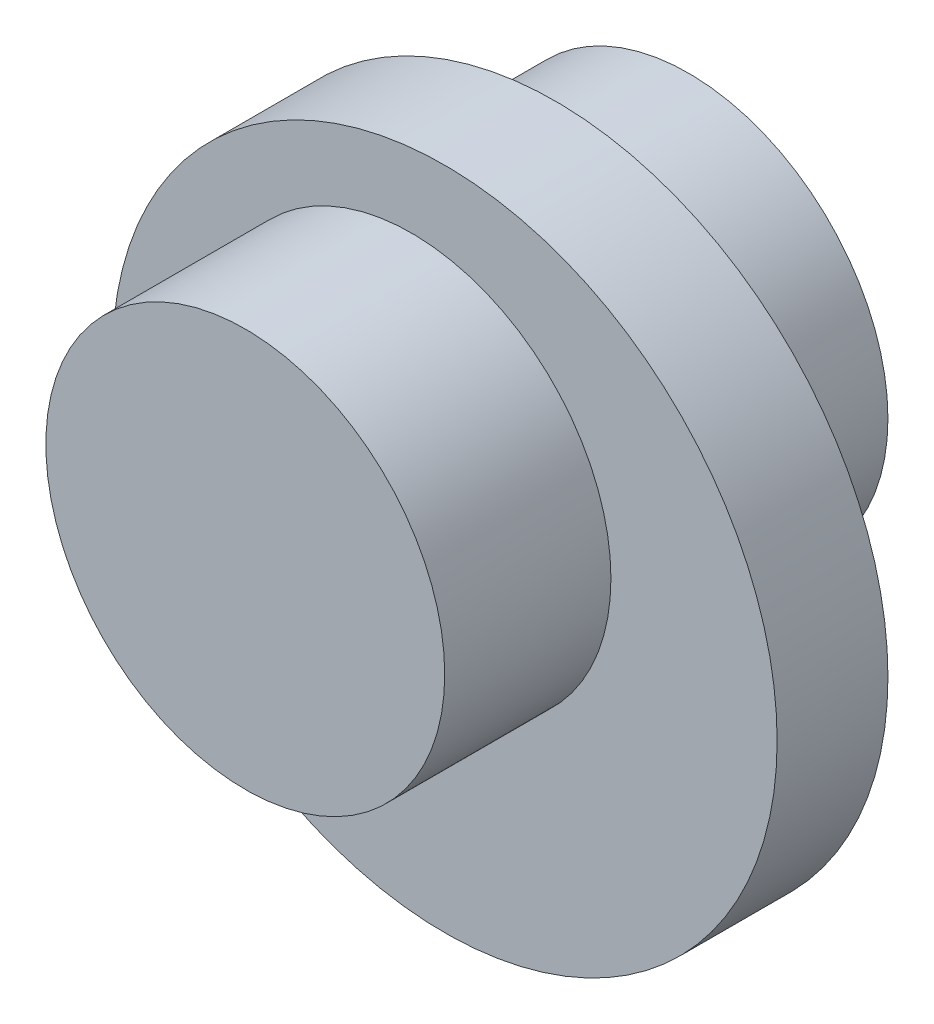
from build123d import *

# Parameters (mm, degrees)
ESQUISSE1_R      = 9
EXTRUSION1_DEPTH = 10
ESQUISSE2_R      = 15
EXTRUSION2_DEPTH = 2.5


with BuildPart() as part:
    # Esquisse1 → Extrusion1 (new, symmetric)
    with BuildSketch(Plane.XY):
        Circle(ESQUISSE1_R)
    extrude(amount=EXTRUSION1_DEPTH, both=True)

    # Esquisse2 → Extrusion2 (add, symmetric)
    with BuildSketch(Plane.XY):
        with Locations((1.5, -2.598076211)):
            Circle(ESQUISSE2_R)
    extrude(amount=EXTRUSION2_DEPTH, both=True)


solid = part.part
